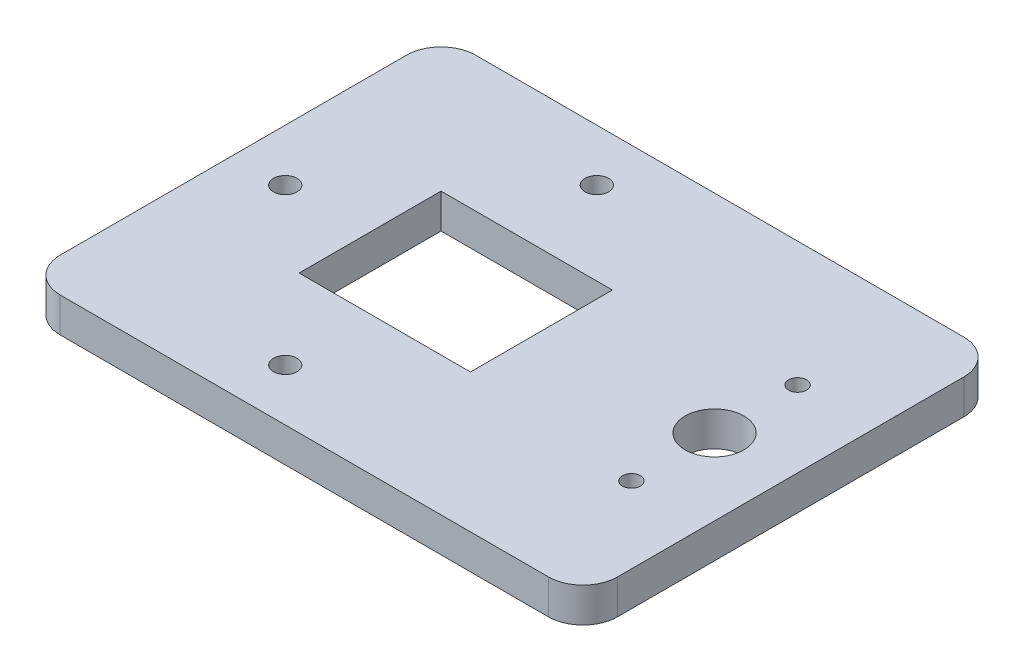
ISO-10303-21;
HEADER;
FILE_DESCRIPTION(('STEP AP214'),'2;1');
FILE_NAME('part.step','',(''),(''),'','','');
FILE_SCHEMA(('AUTOMOTIVE_DESIGN { 1 0 10303 214 1 1 1 1 }'));
ENDSEC;
DATA;
#1=APPLICATION_CONTEXT('core data for automotive mechanical design processes');
#2=APPLICATION_PROTOCOL_DEFINITION('international standard','automotive_design',2000,#1);
#3=PRODUCT_CONTEXT('',#1,'mechanical');
#4=PRODUCT('Part','Part','',(#3));
#5=PRODUCT_RELATED_PRODUCT_CATEGORY('part','',(#4));
#6=PRODUCT_DEFINITION_FORMATION('','',#4);
#7=PRODUCT_DEFINITION_CONTEXT('part definition',#1,'design');
#8=PRODUCT_DEFINITION('design','',#6,#7);
#9=PRODUCT_DEFINITION_SHAPE('','',#8);
#10=(LENGTH_UNIT() NAMED_UNIT(*) SI_UNIT(.MILLI.,.METRE.));
#11=(NAMED_UNIT(*) PLANE_ANGLE_UNIT() SI_UNIT($,.RADIAN.));
#12=(NAMED_UNIT(*) SI_UNIT($,.STERADIAN.) SOLID_ANGLE_UNIT());
#13=UNCERTAINTY_MEASURE_WITH_UNIT(LENGTH_MEASURE(1.E-05),#10,'distance_accuracy_value','');
#14=(GEOMETRIC_REPRESENTATION_CONTEXT(3) GLOBAL_UNCERTAINTY_ASSIGNED_CONTEXT((#13)) GLOBAL_UNIT_ASSIGNED_CONTEXT((#10,
#11,#12)) REPRESENTATION_CONTEXT('',''));
#15=CARTESIAN_POINT('',(0.,0.,0.));
#16=DIRECTION('',(0.,0.,1.));
#17=DIRECTION('',(1.,0.,0.));
#18=AXIS2_PLACEMENT_3D('',#15,#16,#17);
#19=CARTESIAN_POINT('',(60.5,10.,60.));
#20=DIRECTION('',(-1.,0.,0.));
#21=DIRECTION('',(0.,0.,1.));
#22=AXIS2_PLACEMENT_3D('',#19,#20,#21);
#23=PLANE('',#22);
#24=DIRECTION('',(0.,0.,-1.));
#25=VECTOR('',#24,1.);
#26=CARTESIAN_POINT('',(60.5,0.,60.));
#27=LINE('',#26,#25);
#28=CARTESIAN_POINT('',(60.5,0.,50.));
#29=VERTEX_POINT('',#28);
#30=CARTESIAN_POINT('',(60.5,0.,-50.));
#31=VERTEX_POINT('',#30);
#32=EDGE_CURVE('E177',#29,#31,#27,.T.);
#33=ORIENTED_EDGE('',*,*,#32,.T.);
#34=DIRECTION('',(0.,-1.,0.));
#35=VECTOR('',#34,1.);
#36=CARTESIAN_POINT('',(60.5,10.,-50.));
#37=LINE('',#36,#35);
#38=CARTESIAN_POINT('',(60.5,10.,-50.));
#39=VERTEX_POINT('',#38);
#40=EDGE_CURVE('E212',#31,#39,#37,.F.);
#41=ORIENTED_EDGE('',*,*,#40,.T.);
#42=DIRECTION('',(0.,0.,-1.));
#43=VECTOR('',#42,1.);
#44=CARTESIAN_POINT('',(60.5,10.,60.));
#45=LINE('',#44,#43);
#46=CARTESIAN_POINT('',(60.5,10.,50.));
#47=VERTEX_POINT('',#46);
#48=EDGE_CURVE('E182',#47,#39,#45,.T.);
#49=ORIENTED_EDGE('',*,*,#48,.F.);
#50=DIRECTION('',(0.,-1.,0.));
#51=VECTOR('',#50,1.);
#52=CARTESIAN_POINT('',(60.5,10.,50.));
#53=LINE('',#52,#51);
#54=EDGE_CURVE('E209',#47,#29,#53,.T.);
#55=ORIENTED_EDGE('',*,*,#54,.T.);
#56=EDGE_LOOP('',(#33,#41,#49,#55));
#57=FACE_BOUND('',#56,.T.);
#58=ADVANCED_FACE('F43',(#57),#23,.F.);
#59=CARTESIAN_POINT('',(-100.5,10.,-60.));
#60=DIRECTION('',(0.,0.,1.));
#61=DIRECTION('',(1.,0.,0.));
#62=AXIS2_PLACEMENT_3D('',#59,#60,#61);
#63=PLANE('',#62);
#64=DIRECTION('',(-1.,0.,0.));
#65=VECTOR('',#64,1.);
#66=CARTESIAN_POINT('',(-100.5,0.,-60.));
#67=LINE('',#66,#65);
#68=CARTESIAN_POINT('',(50.5,0.,-60.));
#69=VERTEX_POINT('',#68);
#70=CARTESIAN_POINT('',(-90.5,0.,-60.));
#71=VERTEX_POINT('',#70);
#72=EDGE_CURVE('E196',#69,#71,#67,.T.);
#73=ORIENTED_EDGE('',*,*,#72,.T.);
#74=DIRECTION('',(0.,-1.,0.));
#75=VECTOR('',#74,1.);
#76=CARTESIAN_POINT('',(-90.5,10.,-60.));
#77=LINE('',#76,#75);
#78=CARTESIAN_POINT('',(-90.5,10.,-60.));
#79=VERTEX_POINT('',#78);
#80=EDGE_CURVE('E66',#71,#79,#77,.F.);
#81=ORIENTED_EDGE('',*,*,#80,.T.);
#82=DIRECTION('',(-1.,0.,0.));
#83=VECTOR('',#82,1.);
#84=CARTESIAN_POINT('',(-100.5,10.,-60.));
#85=LINE('',#84,#83);
#86=CARTESIAN_POINT('',(50.5,10.,-60.));
#87=VERTEX_POINT('',#86);
#88=EDGE_CURVE('E187',#87,#79,#85,.T.);
#89=ORIENTED_EDGE('',*,*,#88,.F.);
#90=DIRECTION('',(0.,-1.,0.));
#91=VECTOR('',#90,1.);
#92=CARTESIAN_POINT('',(50.5,10.,-60.));
#93=LINE('',#92,#91);
#94=EDGE_CURVE('E194',#87,#69,#93,.T.);
#95=ORIENTED_EDGE('',*,*,#94,.T.);
#96=EDGE_LOOP('',(#73,#81,#89,#95));
#97=FACE_BOUND('',#96,.T.);
#98=ADVANCED_FACE('F245',(#97),#63,.F.);
#99=CARTESIAN_POINT('',(-100.5,10.,60.));
#100=DIRECTION('',(1.,0.,0.));
#101=DIRECTION('',(0.,0.,-1.));
#102=AXIS2_PLACEMENT_3D('',#99,#100,#101);
#103=PLANE('',#102);
#104=DIRECTION('',(0.,0.,1.));
#105=VECTOR('',#104,1.);
#106=CARTESIAN_POINT('',(-100.5,10.,60.));
#107=LINE('',#106,#105);
#108=CARTESIAN_POINT('',(-100.5,10.,-50.));
#109=VERTEX_POINT('',#108);
#110=CARTESIAN_POINT('',(-100.5,10.,50.));
#111=VERTEX_POINT('',#110);
#112=EDGE_CURVE('E186',#109,#111,#107,.T.);
#113=ORIENTED_EDGE('',*,*,#112,.F.);
#114=DIRECTION('',(0.,-1.,0.));
#115=VECTOR('',#114,1.);
#116=CARTESIAN_POINT('',(-100.5,10.,-50.));
#117=LINE('',#116,#115);
#118=CARTESIAN_POINT('',(-100.5,0.,-50.));
#119=VERTEX_POINT('',#118);
#120=EDGE_CURVE('E221',#109,#119,#117,.T.);
#121=ORIENTED_EDGE('',*,*,#120,.T.);
#122=DIRECTION('',(0.,0.,1.));
#123=VECTOR('',#122,1.);
#124=CARTESIAN_POINT('',(-100.5,0.,60.));
#125=LINE('',#124,#123);
#126=CARTESIAN_POINT('',(-100.5,0.,50.));
#127=VERTEX_POINT('',#126);
#128=EDGE_CURVE('E199',#119,#127,#125,.T.);
#129=ORIENTED_EDGE('',*,*,#128,.T.);
#130=DIRECTION('',(0.,-1.,0.));
#131=VECTOR('',#130,1.);
#132=CARTESIAN_POINT('',(-100.5,10.,50.));
#133=LINE('',#132,#131);
#134=EDGE_CURVE('E223',#127,#111,#133,.F.);
#135=ORIENTED_EDGE('',*,*,#134,.T.);
#136=EDGE_LOOP('',(#113,#121,#129,#135));
#137=FACE_BOUND('',#136,.T.);
#138=ADVANCED_FACE('F240',(#137),#103,.F.);
#139=CARTESIAN_POINT('',(-100.5,10.,60.));
#140=DIRECTION('',(0.,0.,-1.));
#141=DIRECTION('',(-1.,0.,0.));
#142=AXIS2_PLACEMENT_3D('',#139,#140,#141);
#143=PLANE('',#142);
#144=DIRECTION('',(1.,0.,0.));
#145=VECTOR('',#144,1.);
#146=CARTESIAN_POINT('',(-100.5,10.,60.));
#147=LINE('',#146,#145);
#148=CARTESIAN_POINT('',(-90.5,10.,60.));
#149=VERTEX_POINT('',#148);
#150=CARTESIAN_POINT('',(50.5,10.,60.));
#151=VERTEX_POINT('',#150);
#152=EDGE_CURVE('E191',#149,#151,#147,.T.);
#153=ORIENTED_EDGE('',*,*,#152,.F.);
#154=DIRECTION('',(0.,-1.,0.));
#155=VECTOR('',#154,1.);
#156=CARTESIAN_POINT('',(-90.5,10.,60.));
#157=LINE('',#156,#155);
#158=CARTESIAN_POINT('',(-90.5,0.,60.));
#159=VERTEX_POINT('',#158);
#160=EDGE_CURVE('E11',#149,#159,#157,.T.);
#161=ORIENTED_EDGE('',*,*,#160,.T.);
#162=DIRECTION('',(1.,0.,0.));
#163=VECTOR('',#162,1.);
#164=CARTESIAN_POINT('',(-100.5,0.,60.));
#165=LINE('',#164,#163);
#166=CARTESIAN_POINT('',(50.5,0.,60.));
#167=VERTEX_POINT('',#166);
#168=EDGE_CURVE('E190',#159,#167,#165,.T.);
#169=ORIENTED_EDGE('',*,*,#168,.T.);
#170=DIRECTION('',(0.,-1.,0.));
#171=VECTOR('',#170,1.);
#172=CARTESIAN_POINT('',(50.5,10.,60.));
#173=LINE('',#172,#171);
#174=EDGE_CURVE('E219',#167,#151,#173,.F.);
#175=ORIENTED_EDGE('',*,*,#174,.T.);
#176=EDGE_LOOP('',(#153,#161,#169,#175));
#177=FACE_BOUND('',#176,.T.);
#178=ADVANCED_FACE('F259',(#177),#143,.F.);
#179=CARTESIAN_POINT('',(0.,10.,0.));
#180=DIRECTION('',(0.,-1.,0.));
#181=DIRECTION('',(0.,0.,-1.));
#182=AXIS2_PLACEMENT_3D('',#179,#180,#181);
#183=PLANE('',#182);
#184=CARTESIAN_POINT('',(38.5000000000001,10.,-24.0000000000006));
#185=DIRECTION('',(0.,1.,0.));
#186=DIRECTION('',(0.,0.,1.));
#187=AXIS2_PLACEMENT_3D('',#184,#185,#186);
#188=CIRCLE('',#187,2.6);
#189=CARTESIAN_POINT('',(38.5000000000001,10.,-21.4000000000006));
#190=VERTEX_POINT('',#189);
#191=EDGE_CURVE('E484',#190,#190,#188,.T.);
#192=ORIENTED_EDGE('',*,*,#191,.F.);
#193=EDGE_LOOP('',(#192));
#194=FACE_BOUND('',#193,.T.);
#195=CARTESIAN_POINT('',(38.5000000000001,10.,23.9999999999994));
#196=DIRECTION('',(0.,1.,0.));
#197=DIRECTION('',(0.,0.,1.));
#198=AXIS2_PLACEMENT_3D('',#195,#196,#197);
#199=CIRCLE('',#198,2.6);
#200=CARTESIAN_POINT('',(38.5000000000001,10.,26.5999999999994));
#201=VERTEX_POINT('',#200);
#202=EDGE_CURVE('E486',#201,#201,#199,.T.);
#203=ORIENTED_EDGE('',*,*,#202,.F.);
#204=EDGE_LOOP('',(#203));
#205=FACE_BOUND('',#204,.T.);
#206=CARTESIAN_POINT('',(-40.500000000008,10.,45.));
#207=DIRECTION('',(0.,-1.,0.));
#208=DIRECTION('',(0.,0.,-1.));
#209=AXIS2_PLACEMENT_3D('',#206,#207,#208);
#210=CIRCLE('',#209,3.4);
#211=CARTESIAN_POINT('',(-40.500000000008,10.,41.6));
#212=VERTEX_POINT('',#211);
#213=EDGE_CURVE('E459',#212,#212,#210,.T.);
#214=ORIENTED_EDGE('',*,*,#213,.T.);
#215=EDGE_LOOP('',(#214));
#216=FACE_BOUND('',#215,.T.);
#217=CARTESIAN_POINT('',(-85.5,10.,-1.12323345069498E-13));
#218=DIRECTION('',(0.,-1.,0.));
#219=DIRECTION('',(0.,0.,-1.));
#220=AXIS2_PLACEMENT_3D('',#217,#218,#219);
#221=CIRCLE('',#220,3.4);
#222=CARTESIAN_POINT('',(-85.5,10.,-3.40000000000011));
#223=VERTEX_POINT('',#222);
#224=EDGE_CURVE('E474',#223,#223,#221,.T.);
#225=ORIENTED_EDGE('',*,*,#224,.T.);
#226=EDGE_LOOP('',(#225));
#227=FACE_BOUND('',#226,.T.);
#228=CARTESIAN_POINT('',(-40.500000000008,10.,-45.));
#229=DIRECTION('',(0.,-1.,0.));
#230=DIRECTION('',(0.,0.,-1.));
#231=AXIS2_PLACEMENT_3D('',#228,#229,#230);
#232=CIRCLE('',#231,3.4);
#233=CARTESIAN_POINT('',(-40.500000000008,10.,-48.4));
#234=VERTEX_POINT('',#233);
#235=EDGE_CURVE('E478',#234,#234,#232,.T.);
#236=ORIENTED_EDGE('',*,*,#235,.T.);
#237=EDGE_LOOP('',(#236));
#238=FACE_BOUND('',#237,.T.);
#239=CARTESIAN_POINT('',(38.5000000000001,10.,-6.04442711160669E-13));
#240=DIRECTION('',(0.,1.,0.));
#241=DIRECTION('',(0.,0.,1.));
#242=AXIS2_PLACEMENT_3D('',#239,#240,#241);
#243=CIRCLE('',#242,8.5);
#244=CARTESIAN_POINT('',(38.5000000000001,10.,8.49999999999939));
#245=VERTEX_POINT('',#244);
#246=EDGE_CURVE('E168',#245,#245,#243,.T.);
#247=ORIENTED_EDGE('',*,*,#246,.F.);
#248=EDGE_LOOP('',(#247));
#249=FACE_BOUND('',#248,.T.);
#250=DIRECTION('',(1.,0.,0.));
#251=VECTOR('',#250,1.);
#252=CARTESIAN_POINT('',(-11.9999999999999,10.,19.9999999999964));
#253=LINE('',#252,#251);
#254=CARTESIAN_POINT('',(-61.4999999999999,10.,19.9999999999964));
#255=VERTEX_POINT('',#254);
#256=CARTESIAN_POINT('',(-11.9999999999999,10.,19.9999999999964));
#257=VERTEX_POINT('',#256);
#258=EDGE_CURVE('E175',#255,#257,#253,.T.);
#259=ORIENTED_EDGE('',*,*,#258,.F.);
#260=DIRECTION('',(0.,0.,1.));
#261=VECTOR('',#260,1.);
#262=CARTESIAN_POINT('',(-61.4999999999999,10.,19.9999999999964));
#263=LINE('',#262,#261);
#264=CARTESIAN_POINT('',(-61.4999999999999,10.,-21.0000000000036));
#265=VERTEX_POINT('',#264);
#266=EDGE_CURVE('E145',#265,#255,#263,.T.);
#267=ORIENTED_EDGE('',*,*,#266,.F.);
#268=DIRECTION('',(-1.,0.,0.));
#269=VECTOR('',#268,1.);
#270=CARTESIAN_POINT('',(-11.9999999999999,10.,-21.0000000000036));
#271=LINE('',#270,#269);
#272=CARTESIAN_POINT('',(-11.9999999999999,10.,-21.0000000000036));
#273=VERTEX_POINT('',#272);
#274=EDGE_CURVE('E159',#273,#265,#271,.T.);
#275=ORIENTED_EDGE('',*,*,#274,.F.);
#276=DIRECTION('',(0.,0.,-1.));
#277=VECTOR('',#276,1.);
#278=CARTESIAN_POINT('',(-11.9999999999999,10.,19.9999999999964));
#279=LINE('',#278,#277);
#280=EDGE_CURVE('E161',#257,#273,#279,.T.);
#281=ORIENTED_EDGE('',*,*,#280,.F.);
#282=EDGE_LOOP('',(#259,#267,#275,#281));
#283=FACE_BOUND('',#282,.T.);
#284=ORIENTED_EDGE('',*,*,#88,.T.);
#285=CARTESIAN_POINT('',(-90.5,10.,-50.));
#286=DIRECTION('',(0.,-1.,0.));
#287=DIRECTION('',(0.,0.,-1.));
#288=AXIS2_PLACEMENT_3D('',#285,#286,#287);
#289=CIRCLE('',#288,10.);
#290=EDGE_CURVE('E51',#79,#109,#289,.F.);
#291=ORIENTED_EDGE('',*,*,#290,.T.);
#292=ORIENTED_EDGE('',*,*,#112,.T.);
#293=CARTESIAN_POINT('',(-90.5,10.,50.));
#294=DIRECTION('',(0.,-1.,0.));
#295=DIRECTION('',(0.,0.,-1.));
#296=AXIS2_PLACEMENT_3D('',#293,#294,#295);
#297=CIRCLE('',#296,10.);
#298=EDGE_CURVE('E59',#111,#149,#297,.F.);
#299=ORIENTED_EDGE('',*,*,#298,.T.);
#300=ORIENTED_EDGE('',*,*,#152,.T.);
#301=CARTESIAN_POINT('',(50.5,10.,50.));
#302=DIRECTION('',(0.,-1.,0.));
#303=DIRECTION('',(0.,0.,-1.));
#304=AXIS2_PLACEMENT_3D('',#301,#302,#303);
#305=CIRCLE('',#304,10.);
#306=EDGE_CURVE('E213',#151,#47,#305,.F.);
#307=ORIENTED_EDGE('',*,*,#306,.T.);
#308=ORIENTED_EDGE('',*,*,#48,.T.);
#309=CARTESIAN_POINT('',(50.5,10.,-50.));
#310=DIRECTION('',(0.,-1.,0.));
#311=DIRECTION('',(0.,0.,-1.));
#312=AXIS2_PLACEMENT_3D('',#309,#310,#311);
#313=CIRCLE('',#312,10.);
#314=EDGE_CURVE('E216',#39,#87,#313,.F.);
#315=ORIENTED_EDGE('',*,*,#314,.T.);
#316=EDGE_LOOP('',(#284,#291,#292,#299,#300,#307,#308,#315));
#317=FACE_BOUND('',#316,.T.);
#318=ADVANCED_FACE('F231',(#194,#205,#216,#227,#238,#249,#283,#317),#183,.F.);
#319=CARTESIAN_POINT('',(0.,0.,0.));
#320=DIRECTION('',(0.,-1.,0.));
#321=DIRECTION('',(0.,0.,-1.));
#322=AXIS2_PLACEMENT_3D('',#319,#320,#321);
#323=PLANE('',#322);
#324=CARTESIAN_POINT('',(38.5000000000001,0.,-24.0000000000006));
#325=DIRECTION('',(0.,1.,0.));
#326=DIRECTION('',(0.,0.,1.));
#327=AXIS2_PLACEMENT_3D('',#324,#325,#326);
#328=CIRCLE('',#327,2.6);
#329=CARTESIAN_POINT('',(38.5000000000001,0.,-21.4000000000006));
#330=VERTEX_POINT('',#329);
#331=EDGE_CURVE('E483',#330,#330,#328,.T.);
#332=ORIENTED_EDGE('',*,*,#331,.T.);
#333=EDGE_LOOP('',(#332));
#334=FACE_BOUND('',#333,.T.);
#335=CARTESIAN_POINT('',(38.5000000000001,0.,23.9999999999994));
#336=DIRECTION('',(0.,1.,0.));
#337=DIRECTION('',(0.,0.,1.));
#338=AXIS2_PLACEMENT_3D('',#335,#336,#337);
#339=CIRCLE('',#338,2.6);
#340=CARTESIAN_POINT('',(38.5000000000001,0.,26.5999999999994));
#341=VERTEX_POINT('',#340);
#342=EDGE_CURVE('E466',#341,#341,#339,.T.);
#343=ORIENTED_EDGE('',*,*,#342,.T.);
#344=EDGE_LOOP('',(#343));
#345=FACE_BOUND('',#344,.T.);
#346=CARTESIAN_POINT('',(-40.500000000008,0.,45.));
#347=DIRECTION('',(0.,-1.,0.));
#348=DIRECTION('',(0.,0.,-1.));
#349=AXIS2_PLACEMENT_3D('',#346,#347,#348);
#350=CIRCLE('',#349,3.4);
#351=CARTESIAN_POINT('',(-40.500000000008,0.,41.6));
#352=VERTEX_POINT('',#351);
#353=EDGE_CURVE('E460',#352,#352,#350,.T.);
#354=ORIENTED_EDGE('',*,*,#353,.F.);
#355=EDGE_LOOP('',(#354));
#356=FACE_BOUND('',#355,.T.);
#357=CARTESIAN_POINT('',(-85.5,0.,-1.12323345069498E-13));
#358=DIRECTION('',(0.,-1.,0.));
#359=DIRECTION('',(0.,0.,-1.));
#360=AXIS2_PLACEMENT_3D('',#357,#358,#359);
#361=CIRCLE('',#360,3.4);
#362=CARTESIAN_POINT('',(-85.5,0.,-3.40000000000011));
#363=VERTEX_POINT('',#362);
#364=EDGE_CURVE('E464',#363,#363,#361,.T.);
#365=ORIENTED_EDGE('',*,*,#364,.F.);
#366=EDGE_LOOP('',(#365));
#367=FACE_BOUND('',#366,.T.);
#368=CARTESIAN_POINT('',(-40.500000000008,0.,-45.));
#369=DIRECTION('',(0.,-1.,0.));
#370=DIRECTION('',(0.,0.,-1.));
#371=AXIS2_PLACEMENT_3D('',#368,#369,#370);
#372=CIRCLE('',#371,3.4);
#373=CARTESIAN_POINT('',(-40.500000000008,0.,-48.4));
#374=VERTEX_POINT('',#373);
#375=EDGE_CURVE('E476',#374,#374,#372,.T.);
#376=ORIENTED_EDGE('',*,*,#375,.F.);
#377=EDGE_LOOP('',(#376));
#378=FACE_BOUND('',#377,.T.);
#379=CARTESIAN_POINT('',(38.5000000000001,0.,-6.04442711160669E-13));
#380=DIRECTION('',(0.,1.,0.));
#381=DIRECTION('',(0.,0.,1.));
#382=AXIS2_PLACEMENT_3D('',#379,#380,#381);
#383=CIRCLE('',#382,8.5);
#384=CARTESIAN_POINT('',(38.5000000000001,0.,8.49999999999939));
#385=VERTEX_POINT('',#384);
#386=EDGE_CURVE('E173',#385,#385,#383,.T.);
#387=ORIENTED_EDGE('',*,*,#386,.T.);
#388=EDGE_LOOP('',(#387));
#389=FACE_BOUND('',#388,.T.);
#390=DIRECTION('',(0.,0.,1.));
#391=VECTOR('',#390,1.);
#392=CARTESIAN_POINT('',(-61.4999999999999,0.,19.9999999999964));
#393=LINE('',#392,#391);
#394=CARTESIAN_POINT('',(-61.4999999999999,0.,-21.0000000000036));
#395=VERTEX_POINT('',#394);
#396=CARTESIAN_POINT('',(-61.4999999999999,0.,19.9999999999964));
#397=VERTEX_POINT('',#396);
#398=EDGE_CURVE('E137',#395,#397,#393,.T.);
#399=ORIENTED_EDGE('',*,*,#398,.T.);
#400=DIRECTION('',(1.,0.,0.));
#401=VECTOR('',#400,1.);
#402=CARTESIAN_POINT('',(-11.9999999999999,0.,19.9999999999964));
#403=LINE('',#402,#401);
#404=CARTESIAN_POINT('',(-11.9999999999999,0.,19.9999999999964));
#405=VERTEX_POINT('',#404);
#406=EDGE_CURVE('E151',#397,#405,#403,.T.);
#407=ORIENTED_EDGE('',*,*,#406,.T.);
#408=DIRECTION('',(0.,0.,-1.));
#409=VECTOR('',#408,1.);
#410=CARTESIAN_POINT('',(-11.9999999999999,0.,19.9999999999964));
#411=LINE('',#410,#409);
#412=CARTESIAN_POINT('',(-11.9999999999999,0.,-21.0000000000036));
#413=VERTEX_POINT('',#412);
#414=EDGE_CURVE('E155',#405,#413,#411,.T.);
#415=ORIENTED_EDGE('',*,*,#414,.T.);
#416=DIRECTION('',(-1.,0.,0.));
#417=VECTOR('',#416,1.);
#418=CARTESIAN_POINT('',(-11.9999999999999,0.,-21.0000000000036));
#419=LINE('',#418,#417);
#420=EDGE_CURVE('E147',#413,#395,#419,.T.);
#421=ORIENTED_EDGE('',*,*,#420,.T.);
#422=EDGE_LOOP('',(#399,#407,#415,#421));
#423=FACE_BOUND('',#422,.T.);
#424=ORIENTED_EDGE('',*,*,#128,.F.);
#425=CARTESIAN_POINT('',(-90.5,0.,-50.));
#426=DIRECTION('',(0.,-1.,0.));
#427=DIRECTION('',(0.,0.,-1.));
#428=AXIS2_PLACEMENT_3D('',#425,#426,#427);
#429=CIRCLE('',#428,10.);
#430=EDGE_CURVE('E226',#119,#71,#429,.T.);
#431=ORIENTED_EDGE('',*,*,#430,.T.);
#432=ORIENTED_EDGE('',*,*,#72,.F.);
#433=CARTESIAN_POINT('',(50.5,0.,-50.));
#434=DIRECTION('',(0.,-1.,0.));
#435=DIRECTION('',(0.,0.,-1.));
#436=AXIS2_PLACEMENT_3D('',#433,#434,#435);
#437=CIRCLE('',#436,10.);
#438=EDGE_CURVE('E210',#69,#31,#437,.T.);
#439=ORIENTED_EDGE('',*,*,#438,.T.);
#440=ORIENTED_EDGE('',*,*,#32,.F.);
#441=CARTESIAN_POINT('',(50.5,0.,50.));
#442=DIRECTION('',(0.,-1.,0.));
#443=DIRECTION('',(0.,0.,-1.));
#444=AXIS2_PLACEMENT_3D('',#441,#442,#443);
#445=CIRCLE('',#444,10.);
#446=EDGE_CURVE('E202',#29,#167,#445,.T.);
#447=ORIENTED_EDGE('',*,*,#446,.T.);
#448=ORIENTED_EDGE('',*,*,#168,.F.);
#449=CARTESIAN_POINT('',(-90.5,0.,50.));
#450=DIRECTION('',(0.,-1.,0.));
#451=DIRECTION('',(0.,0.,-1.));
#452=AXIS2_PLACEMENT_3D('',#449,#450,#451);
#453=CIRCLE('',#452,10.);
#454=EDGE_CURVE('E228',#159,#127,#453,.T.);
#455=ORIENTED_EDGE('',*,*,#454,.T.);
#456=EDGE_LOOP('',(#424,#431,#432,#439,#440,#447,#448,#455));
#457=FACE_BOUND('',#456,.T.);
#458=ADVANCED_FACE('F160',(#334,#345,#356,#367,#378,#389,#423,#457),#323,.T.);
#459=CARTESIAN_POINT('',(50.5,10.,-50.));
#460=DIRECTION('',(0.,-1.,0.));
#461=DIRECTION('',(0.,0.,-1.));
#462=AXIS2_PLACEMENT_3D('',#459,#460,#461);
#463=CYLINDRICAL_SURFACE('',#462,10.);
#464=ORIENTED_EDGE('',*,*,#314,.F.);
#465=ORIENTED_EDGE('',*,*,#40,.F.);
#466=ORIENTED_EDGE('',*,*,#438,.F.);
#467=ORIENTED_EDGE('',*,*,#94,.F.);
#468=EDGE_LOOP('',(#464,#465,#466,#467));
#469=FACE_BOUND('',#468,.T.);
#470=ADVANCED_FACE('F246',(#469),#463,.T.);
#471=CARTESIAN_POINT('',(50.5,10.,50.));
#472=DIRECTION('',(0.,-1.,0.));
#473=DIRECTION('',(0.,0.,-1.));
#474=AXIS2_PLACEMENT_3D('',#471,#472,#473);
#475=CYLINDRICAL_SURFACE('',#474,10.);
#476=ORIENTED_EDGE('',*,*,#306,.F.);
#477=ORIENTED_EDGE('',*,*,#174,.F.);
#478=ORIENTED_EDGE('',*,*,#446,.F.);
#479=ORIENTED_EDGE('',*,*,#54,.F.);
#480=EDGE_LOOP('',(#476,#477,#478,#479));
#481=FACE_BOUND('',#480,.T.);
#482=ADVANCED_FACE('F251',(#481),#475,.T.);
#483=CARTESIAN_POINT('',(-61.4999999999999,0.,19.9999999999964));
#484=DIRECTION('',(-1.,0.,0.));
#485=DIRECTION('',(0.,0.,1.));
#486=AXIS2_PLACEMENT_3D('',#483,#484,#485);
#487=PLANE('',#486);
#488=ORIENTED_EDGE('',*,*,#266,.T.);
#489=DIRECTION('',(0.,1.,0.));
#490=VECTOR('',#489,1.);
#491=CARTESIAN_POINT('',(-61.4999999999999,0.,19.9999999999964));
#492=LINE('',#491,#490);
#493=EDGE_CURVE('E135',#397,#255,#492,.T.);
#494=ORIENTED_EDGE('',*,*,#493,.F.);
#495=ORIENTED_EDGE('',*,*,#398,.F.);
#496=DIRECTION('',(0.,1.,0.));
#497=VECTOR('',#496,1.);
#498=CARTESIAN_POINT('',(-61.4999999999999,0.,-21.0000000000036));
#499=LINE('',#498,#497);
#500=EDGE_CURVE('E180',#395,#265,#499,.T.);
#501=ORIENTED_EDGE('',*,*,#500,.T.);
#502=EDGE_LOOP('',(#488,#494,#495,#501));
#503=FACE_BOUND('',#502,.T.);
#504=ADVANCED_FACE('F140',(#503),#487,.F.);
#505=CARTESIAN_POINT('',(-11.9999999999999,0.,-21.0000000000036));
#506=DIRECTION('',(0.,0.,-1.));
#507=DIRECTION('',(-1.,0.,0.));
#508=AXIS2_PLACEMENT_3D('',#505,#506,#507);
#509=PLANE('',#508);
#510=ORIENTED_EDGE('',*,*,#274,.T.);
#511=ORIENTED_EDGE('',*,*,#500,.F.);
#512=ORIENTED_EDGE('',*,*,#420,.F.);
#513=DIRECTION('',(0.,1.,0.));
#514=VECTOR('',#513,1.);
#515=CARTESIAN_POINT('',(-11.9999999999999,0.,-21.0000000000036));
#516=LINE('',#515,#514);
#517=EDGE_CURVE('E179',#413,#273,#516,.T.);
#518=ORIENTED_EDGE('',*,*,#517,.T.);
#519=EDGE_LOOP('',(#510,#511,#512,#518));
#520=FACE_BOUND('',#519,.T.);
#521=ADVANCED_FACE('F288',(#520),#509,.F.);
#522=CARTESIAN_POINT('',(-11.9999999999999,0.,19.9999999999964));
#523=DIRECTION('',(1.,0.,0.));
#524=DIRECTION('',(0.,0.,-1.));
#525=AXIS2_PLACEMENT_3D('',#522,#523,#524);
#526=PLANE('',#525);
#527=ORIENTED_EDGE('',*,*,#280,.T.);
#528=ORIENTED_EDGE('',*,*,#517,.F.);
#529=ORIENTED_EDGE('',*,*,#414,.F.);
#530=DIRECTION('',(0.,1.,0.));
#531=VECTOR('',#530,1.);
#532=CARTESIAN_POINT('',(-11.9999999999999,0.,19.9999999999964));
#533=LINE('',#532,#531);
#534=EDGE_CURVE('E146',#405,#257,#533,.T.);
#535=ORIENTED_EDGE('',*,*,#534,.T.);
#536=EDGE_LOOP('',(#527,#528,#529,#535));
#537=FACE_BOUND('',#536,.T.);
#538=ADVANCED_FACE('F293',(#537),#526,.F.);
#539=CARTESIAN_POINT('',(-11.9999999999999,0.,19.9999999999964));
#540=DIRECTION('',(0.,0.,1.));
#541=DIRECTION('',(1.,0.,0.));
#542=AXIS2_PLACEMENT_3D('',#539,#540,#541);
#543=PLANE('',#542);
#544=ORIENTED_EDGE('',*,*,#258,.T.);
#545=ORIENTED_EDGE('',*,*,#534,.F.);
#546=ORIENTED_EDGE('',*,*,#406,.F.);
#547=ORIENTED_EDGE('',*,*,#493,.T.);
#548=EDGE_LOOP('',(#544,#545,#546,#547));
#549=FACE_BOUND('',#548,.T.);
#550=ADVANCED_FACE('F152',(#549),#543,.F.);
#551=CARTESIAN_POINT('',(38.5000000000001,0.,-6.04442711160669E-13));
#552=DIRECTION('',(0.,1.,0.));
#553=DIRECTION('',(0.,0.,1.));
#554=AXIS2_PLACEMENT_3D('',#551,#552,#553);
#555=CYLINDRICAL_SURFACE('',#554,8.5);
#556=ORIENTED_EDGE('',*,*,#386,.F.);
#557=EDGE_LOOP('',(#556));
#558=FACE_BOUND('',#557,.T.);
#559=ORIENTED_EDGE('',*,*,#246,.T.);
#560=EDGE_LOOP('',(#559));
#561=FACE_BOUND('',#560,.T.);
#562=ADVANCED_FACE('F272',(#558,#561),#555,.F.);
#563=CARTESIAN_POINT('',(-90.5,10.,-50.));
#564=DIRECTION('',(0.,-1.,0.));
#565=DIRECTION('',(0.,0.,-1.));
#566=AXIS2_PLACEMENT_3D('',#563,#564,#565);
#567=CYLINDRICAL_SURFACE('',#566,10.);
#568=ORIENTED_EDGE('',*,*,#290,.F.);
#569=ORIENTED_EDGE('',*,*,#80,.F.);
#570=ORIENTED_EDGE('',*,*,#430,.F.);
#571=ORIENTED_EDGE('',*,*,#120,.F.);
#572=EDGE_LOOP('',(#568,#569,#570,#571));
#573=FACE_BOUND('',#572,.T.);
#574=ADVANCED_FACE('F239',(#573),#567,.T.);
#575=CARTESIAN_POINT('',(-90.5,10.,50.));
#576=DIRECTION('',(0.,-1.,0.));
#577=DIRECTION('',(0.,0.,-1.));
#578=AXIS2_PLACEMENT_3D('',#575,#576,#577);
#579=CYLINDRICAL_SURFACE('',#578,10.);
#580=ORIENTED_EDGE('',*,*,#298,.F.);
#581=ORIENTED_EDGE('',*,*,#134,.F.);
#582=ORIENTED_EDGE('',*,*,#454,.F.);
#583=ORIENTED_EDGE('',*,*,#160,.F.);
#584=EDGE_LOOP('',(#580,#581,#582,#583));
#585=FACE_BOUND('',#584,.T.);
#586=ADVANCED_FACE('F44',(#585),#579,.T.);
#587=CARTESIAN_POINT('',(-40.500000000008,10.,-45.));
#588=DIRECTION('',(0.,-1.,0.));
#589=DIRECTION('',(0.,0.,-1.));
#590=AXIS2_PLACEMENT_3D('',#587,#588,#589);
#591=CYLINDRICAL_SURFACE('',#590,3.4);
#592=ORIENTED_EDGE('',*,*,#235,.F.);
#593=EDGE_LOOP('',(#592));
#594=FACE_BOUND('',#593,.T.);
#595=ORIENTED_EDGE('',*,*,#375,.T.);
#596=EDGE_LOOP('',(#595));
#597=FACE_BOUND('',#596,.T.);
#598=ADVANCED_FACE('F262',(#594,#597),#591,.F.);
#599=CARTESIAN_POINT('',(-85.5,10.,-1.12323345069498E-13));
#600=DIRECTION('',(0.,-1.,0.));
#601=DIRECTION('',(0.,0.,-1.));
#602=AXIS2_PLACEMENT_3D('',#599,#600,#601);
#603=CYLINDRICAL_SURFACE('',#602,3.4);
#604=ORIENTED_EDGE('',*,*,#224,.F.);
#605=EDGE_LOOP('',(#604));
#606=FACE_BOUND('',#605,.T.);
#607=ORIENTED_EDGE('',*,*,#364,.T.);
#608=EDGE_LOOP('',(#607));
#609=FACE_BOUND('',#608,.T.);
#610=ADVANCED_FACE('F266',(#606,#609),#603,.F.);
#611=CARTESIAN_POINT('',(-40.500000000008,10.,45.));
#612=DIRECTION('',(0.,-1.,0.));
#613=DIRECTION('',(0.,0.,-1.));
#614=AXIS2_PLACEMENT_3D('',#611,#612,#613);
#615=CYLINDRICAL_SURFACE('',#614,3.4);
#616=ORIENTED_EDGE('',*,*,#213,.F.);
#617=EDGE_LOOP('',(#616));
#618=FACE_BOUND('',#617,.T.);
#619=ORIENTED_EDGE('',*,*,#353,.T.);
#620=EDGE_LOOP('',(#619));
#621=FACE_BOUND('',#620,.T.);
#622=ADVANCED_FACE('F347',(#618,#621),#615,.F.);
#623=CARTESIAN_POINT('',(38.5000000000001,0.,23.9999999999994));
#624=DIRECTION('',(0.,1.,0.));
#625=DIRECTION('',(0.,0.,1.));
#626=AXIS2_PLACEMENT_3D('',#623,#624,#625);
#627=CYLINDRICAL_SURFACE('',#626,2.6);
#628=ORIENTED_EDGE('',*,*,#342,.F.);
#629=EDGE_LOOP('',(#628));
#630=FACE_BOUND('',#629,.T.);
#631=ORIENTED_EDGE('',*,*,#202,.T.);
#632=EDGE_LOOP('',(#631));
#633=FACE_BOUND('',#632,.T.);
#634=ADVANCED_FACE('F356',(#630,#633),#627,.F.);
#635=CARTESIAN_POINT('',(38.5000000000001,0.,-24.0000000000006));
#636=DIRECTION('',(0.,1.,0.));
#637=DIRECTION('',(0.,0.,1.));
#638=AXIS2_PLACEMENT_3D('',#635,#636,#637);
#639=CYLINDRICAL_SURFACE('',#638,2.6);
#640=ORIENTED_EDGE('',*,*,#331,.F.);
#641=EDGE_LOOP('',(#640));
#642=FACE_BOUND('',#641,.T.);
#643=ORIENTED_EDGE('',*,*,#191,.T.);
#644=EDGE_LOOP('',(#643));
#645=FACE_BOUND('',#644,.T.);
#646=ADVANCED_FACE('F367',(#642,#645),#639,.F.);
#647=CLOSED_SHELL('',(#58,#98,#138,#178,#318,#458,#470,#482,#504,#521,#538,#550,#562,#574,#586,
#598,#610,#622,#634,#646));
#648=MANIFOLD_SOLID_BREP('B2',#647);
#649=ADVANCED_BREP_SHAPE_REPRESENTATION('',(#18,#648),#14);
#650=SHAPE_DEFINITION_REPRESENTATION(#9,#649);
ENDSEC;
END-ISO-10303-21;
